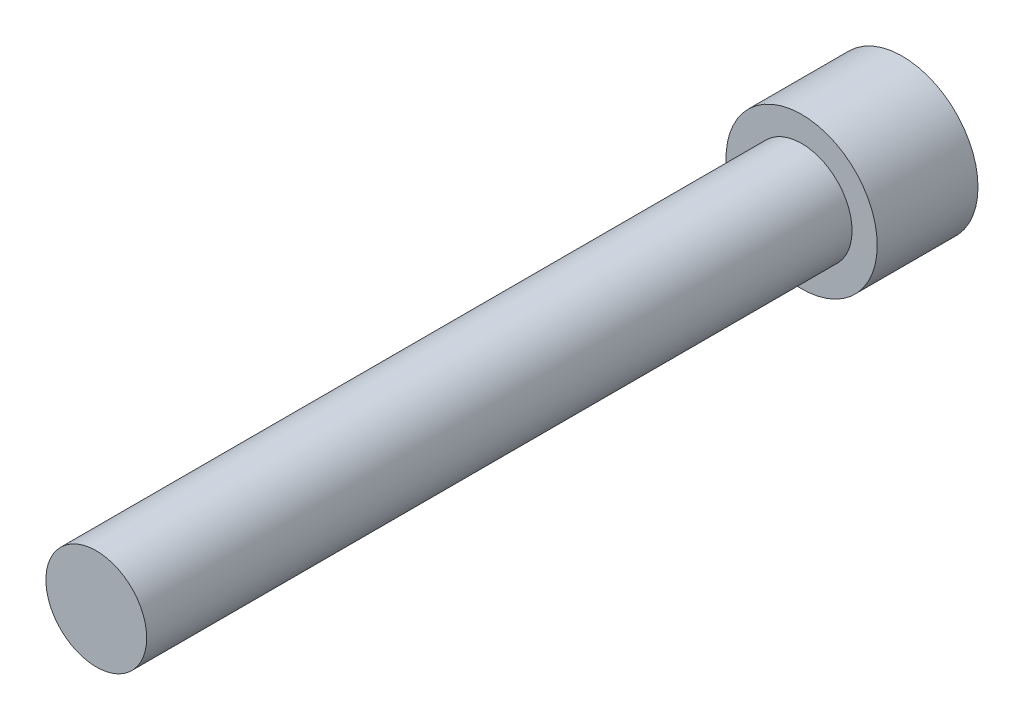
from build123d import *

# Parameters (mm, degrees)
HEX_2_DEPTH = 3.556


with BuildPart() as part:
    # Sketch6 → Revolve1 (revolve)
    with BuildSketch(Plane(origin=(0, 0, 0), x_dir=(0, 0, -1), z_dir=(1, 0, 0)), mode=Mode.PRIVATE) as revolve1_sk:
        Polygon((-44.45, 0), (-44.45, -3.175), (0, -3.175), (0, -4.7625), (6.35, -4.7625), (6.35, 0), align=None)
    revolve(revolve1_sk.sketch.rotate(Axis((0, 0, 44.45), (0, 0, -1)), 270), axis=Axis((0, 0, 44.45), (0, 0, -1)))

    # Sketch7 → HEX 2 (cut)
    with BuildSketch(Plane(origin=(0, 0, -6.35), x_dir=(-1, 0, 0), z_dir=(0, 0, -1))):
        Polygon((-2.3876, 1.378481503), (-2.3876, -1.378481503), (0, -2.756963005), (2.3876, -1.378481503), (2.3876, 1.378481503), (0, 2.756963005), align=None)
    extrude(amount=-HEX_2_DEPTH, mode=Mode.SUBTRACT)


solid = part.part
